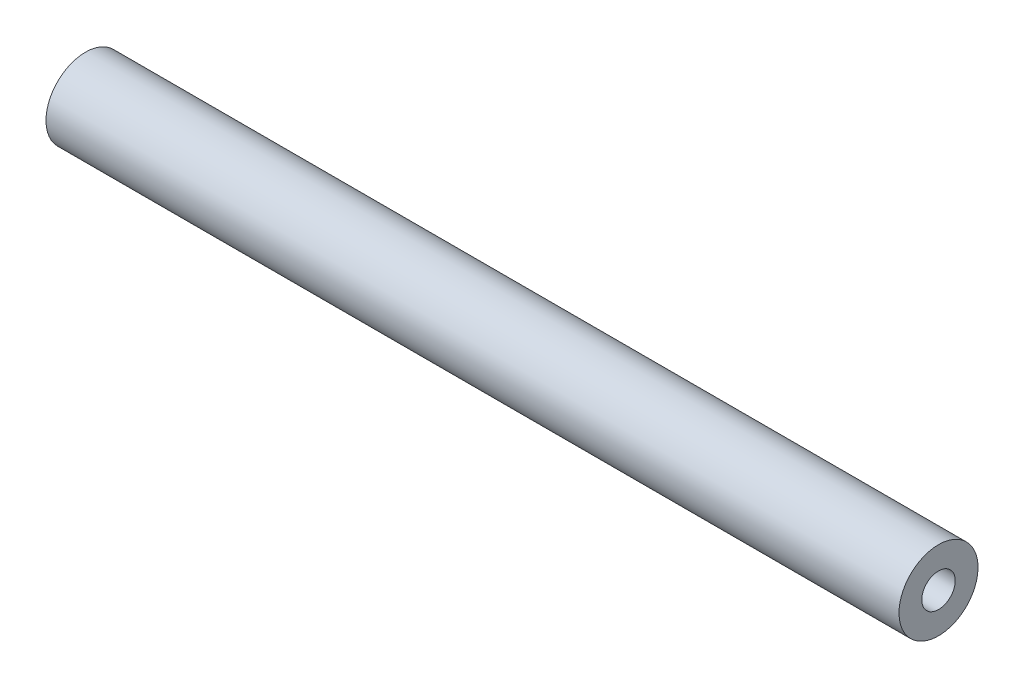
from build123d import *


with BuildPart() as part:
    # Sketch2 → Revolve1 (revolve)
    with BuildSketch(Plane.XY):
        Polygon((144.851912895, 0), (17.073087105, 0), (15.24, 3.175), (0, 3.175), (0, 7.5), (161.925, 7.5), (161.925, 3.175), (146.685, 3.175), align=None)
    revolve(axis=Axis((144.851912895, 0, 0), (-1, 0, 0)))


solid = part.part
